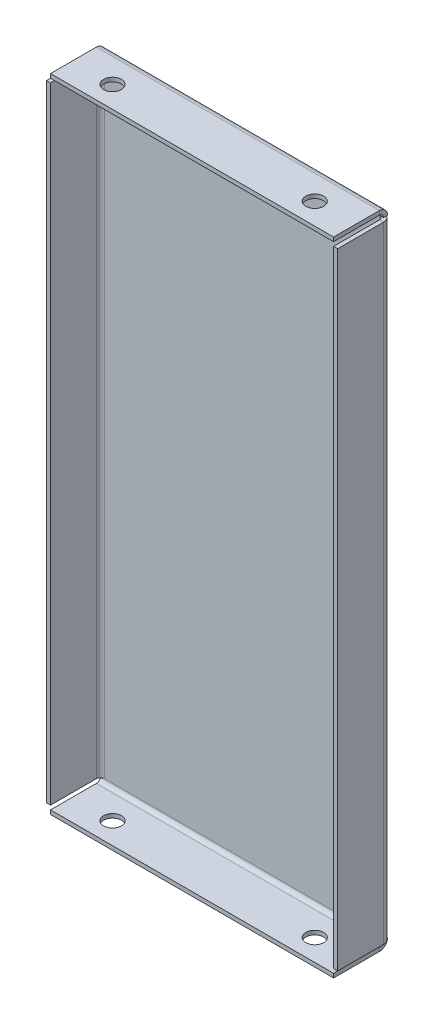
ISO-10303-21;
HEADER;
FILE_DESCRIPTION(('STEP AP214'),'2;1');
FILE_NAME('part.step','',(''),(''),'','','');
FILE_SCHEMA(('AUTOMOTIVE_DESIGN { 1 0 10303 214 1 1 1 1 }'));
ENDSEC;
DATA;
#1=APPLICATION_CONTEXT('core data for automotive mechanical design processes');
#2=APPLICATION_PROTOCOL_DEFINITION('international standard','automotive_design',2000,#1);
#3=PRODUCT_CONTEXT('',#1,'mechanical');
#4=PRODUCT('Part','Part','',(#3));
#5=PRODUCT_RELATED_PRODUCT_CATEGORY('part','',(#4));
#6=PRODUCT_DEFINITION_FORMATION('','',#4);
#7=PRODUCT_DEFINITION_CONTEXT('part definition',#1,'design');
#8=PRODUCT_DEFINITION('design','',#6,#7);
#9=PRODUCT_DEFINITION_SHAPE('','',#8);
#10=(LENGTH_UNIT() NAMED_UNIT(*) SI_UNIT(.MILLI.,.METRE.));
#11=(NAMED_UNIT(*) PLANE_ANGLE_UNIT() SI_UNIT($,.RADIAN.));
#12=(NAMED_UNIT(*) SI_UNIT($,.STERADIAN.) SOLID_ANGLE_UNIT());
#13=UNCERTAINTY_MEASURE_WITH_UNIT(LENGTH_MEASURE(1.E-05),#10,'distance_accuracy_value','');
#14=(GEOMETRIC_REPRESENTATION_CONTEXT(3) GLOBAL_UNCERTAINTY_ASSIGNED_CONTEXT((#13)) GLOBAL_UNIT_ASSIGNED_CONTEXT((#10,
#11,#12)) REPRESENTATION_CONTEXT('',''));
#15=CARTESIAN_POINT('',(0.,0.,0.));
#16=DIRECTION('',(0.,0.,1.));
#17=DIRECTION('',(1.,0.,0.));
#18=AXIS2_PLACEMENT_3D('',#15,#16,#17);
#19=CARTESIAN_POINT('',(105.,233.5,1.50000000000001));
#20=DIRECTION('',(0.,-1.,0.));
#21=DIRECTION('',(0.,0.,-1.));
#22=AXIS2_PLACEMENT_3D('',#19,#20,#21);
#23=PLANE('',#22);
#24=DIRECTION('',(0.,0.,-1.));
#25=VECTOR('',#24,1.);
#26=CARTESIAN_POINT('',(105.,233.5,1.50000000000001));
#27=LINE('',#26,#25);
#28=CARTESIAN_POINT('',(105.,233.5,0.401923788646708));
#29=VERTEX_POINT('',#28);
#30=CARTESIAN_POINT('',(105.,233.5,0.));
#31=VERTEX_POINT('',#30);
#32=EDGE_CURVE('E56',#29,#31,#27,.T.);
#33=ORIENTED_EDGE('',*,*,#32,.F.);
#34=CARTESIAN_POINT('',(103.5,233.5,3.));
#35=DIRECTION('',(0.,1.,0.));
#36=DIRECTION('',(0.,0.,1.));
#37=AXIS2_PLACEMENT_3D('',#34,#35,#36);
#38=CIRCLE('',#37,2.99999999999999);
#39=CARTESIAN_POINT('',(103.5,233.5,0.));
#40=VERTEX_POINT('',#39);
#41=EDGE_CURVE('E11',#29,#40,#38,.T.);
#42=ORIENTED_EDGE('',*,*,#41,.T.);
#43=DIRECTION('',(-1.,0.,0.));
#44=VECTOR('',#43,1.);
#45=CARTESIAN_POINT('',(0.,233.5,0.));
#46=LINE('',#45,#44);
#47=EDGE_CURVE('E295',#31,#40,#46,.T.);
#48=ORIENTED_EDGE('',*,*,#47,.F.);
#49=EDGE_LOOP('',(#33,#42,#48));
#50=FACE_BOUND('',#49,.T.);
#51=ADVANCED_FACE('F38',(#50),#23,.T.);
#52=CARTESIAN_POINT('',(103.5,1.5,1.50000000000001));
#53=DIRECTION('',(0.,1.,0.));
#54=DIRECTION('',(0.,0.,1.));
#55=AXIS2_PLACEMENT_3D('',#52,#53,#54);
#56=PLANE('',#55);
#57=DIRECTION('',(1.,0.,0.));
#58=VECTOR('',#57,1.);
#59=CARTESIAN_POINT('',(105.,1.5,0.));
#60=LINE('',#59,#58);
#61=CARTESIAN_POINT('',(105.,1.50000000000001,0.));
#62=VERTEX_POINT('',#61);
#63=CARTESIAN_POINT('',(103.5,1.50000000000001,0.));
#64=VERTEX_POINT('',#63);
#65=EDGE_CURVE('E428',#62,#64,#60,.F.);
#66=ORIENTED_EDGE('',*,*,#65,.T.);
#67=CARTESIAN_POINT('',(103.5,1.5,3.));
#68=DIRECTION('',(0.,1.,0.));
#69=DIRECTION('',(0.,0.,1.));
#70=AXIS2_PLACEMENT_3D('',#67,#68,#69);
#71=CIRCLE('',#70,2.99999999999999);
#72=CARTESIAN_POINT('',(105.,1.5,0.401923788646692));
#73=VERTEX_POINT('',#72);
#74=EDGE_CURVE('E288',#64,#73,#71,.F.);
#75=ORIENTED_EDGE('',*,*,#74,.T.);
#76=DIRECTION('',(0.,0.,-1.));
#77=VECTOR('',#76,1.);
#78=CARTESIAN_POINT('',(105.,1.5,1.5));
#79=LINE('',#78,#77);
#80=EDGE_CURVE('E436',#73,#62,#79,.T.);
#81=ORIENTED_EDGE('',*,*,#80,.T.);
#82=EDGE_LOOP('',(#66,#75,#81));
#83=FACE_BOUND('',#82,.T.);
#84=ADVANCED_FACE('F585',(#83),#56,.T.);
#85=CARTESIAN_POINT('',(0.,235.,1.5));
#86=DIRECTION('',(0.,0.,-1.));
#87=DIRECTION('',(-1.,0.,0.));
#88=AXIS2_PLACEMENT_3D('',#85,#86,#87);
#89=PLANE('',#88);
#90=DIRECTION('',(0.,1.,0.));
#91=VECTOR('',#90,1.);
#92=CARTESIAN_POINT('',(103.5,233.5,1.50000000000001));
#93=LINE('',#92,#91);
#94=CARTESIAN_POINT('',(103.5,233.5,1.50000000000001));
#95=VERTEX_POINT('',#94);
#96=CARTESIAN_POINT('',(103.5,1.5,1.5));
#97=VERTEX_POINT('',#96);
#98=EDGE_CURVE('E278',#95,#97,#93,.F.);
#99=ORIENTED_EDGE('',*,*,#98,.F.);
#100=DIRECTION('',(-1.,0.,0.));
#101=VECTOR('',#100,1.);
#102=CARTESIAN_POINT('',(0.,233.5,1.50000000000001));
#103=LINE('',#102,#101);
#104=CARTESIAN_POINT('',(1.50000000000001,233.5,1.50000000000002));
#105=VERTEX_POINT('',#104);
#106=EDGE_CURVE('E503',#105,#95,#103,.F.);
#107=ORIENTED_EDGE('',*,*,#106,.F.);
#108=DIRECTION('',(0.,-1.,0.));
#109=VECTOR('',#108,1.);
#110=CARTESIAN_POINT('',(1.50000000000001,1.5,1.50000000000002));
#111=LINE('',#110,#109);
#112=CARTESIAN_POINT('',(1.50000000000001,1.50000000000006,1.50000000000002));
#113=VERTEX_POINT('',#112);
#114=EDGE_CURVE('E347',#113,#105,#111,.F.);
#115=ORIENTED_EDGE('',*,*,#114,.F.);
#116=DIRECTION('',(1.,0.,0.));
#117=VECTOR('',#116,1.);
#118=CARTESIAN_POINT('',(105.,1.5,1.5));
#119=LINE('',#118,#117);
#120=EDGE_CURVE('E64',#97,#113,#119,.F.);
#121=ORIENTED_EDGE('',*,*,#120,.F.);
#122=EDGE_LOOP('',(#99,#107,#115,#121));
#123=FACE_BOUND('',#122,.T.);
#124=ADVANCED_FACE('F40',(#123),#89,.F.);
#125=CARTESIAN_POINT('',(0.,235.,0.));
#126=DIRECTION('',(0.,0.,-1.));
#127=DIRECTION('',(-1.,0.,0.));
#128=AXIS2_PLACEMENT_3D('',#125,#126,#127);
#129=PLANE('',#128);
#130=DIRECTION('',(-1.,0.,0.));
#131=VECTOR('',#130,1.);
#132=CARTESIAN_POINT('',(0.,233.5,0.));
#133=LINE('',#132,#131);
#134=CARTESIAN_POINT('',(1.50000000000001,233.5,0.));
#135=VERTEX_POINT('',#134);
#136=EDGE_CURVE('E511',#135,#40,#133,.F.);
#137=ORIENTED_EDGE('',*,*,#136,.T.);
#138=DIRECTION('',(0.,1.,0.));
#139=VECTOR('',#138,1.);
#140=CARTESIAN_POINT('',(103.5,233.5,0.));
#141=LINE('',#140,#139);
#142=EDGE_CURVE('E225',#40,#64,#141,.F.);
#143=ORIENTED_EDGE('',*,*,#142,.T.);
#144=CARTESIAN_POINT('',(1.5,1.50000000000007,0.));
#145=VERTEX_POINT('',#144);
#146=EDGE_CURVE('E432',#64,#145,#60,.F.);
#147=ORIENTED_EDGE('',*,*,#146,.T.);
#148=DIRECTION('',(0.,-1.,0.));
#149=VECTOR('',#148,1.);
#150=CARTESIAN_POINT('',(1.50000000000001,1.5,0.));
#151=LINE('',#150,#149);
#152=EDGE_CURVE('E354',#145,#135,#151,.F.);
#153=ORIENTED_EDGE('',*,*,#152,.T.);
#154=EDGE_LOOP('',(#137,#143,#147,#153));
#155=FACE_BOUND('',#154,.T.);
#156=ADVANCED_FACE('F578',(#155),#129,.T.);
#157=CARTESIAN_POINT('',(0.,1.5,1.5));
#158=DIRECTION('',(0.,1.,0.));
#159=DIRECTION('',(-1.,0.,0.));
#160=AXIS2_PLACEMENT_3D('',#157,#158,#159);
#161=PLANE('',#160);
#162=DIRECTION('',(0.,0.,-1.));
#163=VECTOR('',#162,1.);
#164=CARTESIAN_POINT('',(0.,1.5,1.5));
#165=LINE('',#164,#163);
#166=CARTESIAN_POINT('',(0.,1.5,0.401923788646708));
#167=VERTEX_POINT('',#166);
#168=CARTESIAN_POINT('',(0.,1.50000000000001,0.));
#169=VERTEX_POINT('',#168);
#170=EDGE_CURVE('E445',#167,#169,#165,.T.);
#171=ORIENTED_EDGE('',*,*,#170,.F.);
#172=CARTESIAN_POINT('',(1.50000000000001,1.50000000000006,3.));
#173=DIRECTION('',(0.,-1.,0.));
#174=DIRECTION('',(0.,0.,-1.));
#175=AXIS2_PLACEMENT_3D('',#172,#173,#174);
#176=CIRCLE('',#175,2.99999999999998);
#177=EDGE_CURVE('E48',#167,#145,#176,.T.);
#178=ORIENTED_EDGE('',*,*,#177,.T.);
#179=DIRECTION('',(1.,0.,0.));
#180=VECTOR('',#179,1.);
#181=CARTESIAN_POINT('',(105.,1.50000000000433,0.));
#182=LINE('',#181,#180);
#183=EDGE_CURVE('E370',#169,#145,#182,.T.);
#184=ORIENTED_EDGE('',*,*,#183,.F.);
#185=EDGE_LOOP('',(#171,#178,#184));
#186=FACE_BOUND('',#185,.T.);
#187=ADVANCED_FACE('F680',(#186),#161,.T.);
#188=CARTESIAN_POINT('',(1.50000000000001,233.5,1.50000000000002));
#189=DIRECTION('',(0.,-1.,0.));
#190=DIRECTION('',(0.,0.,-1.));
#191=AXIS2_PLACEMENT_3D('',#188,#189,#190);
#192=PLANE('',#191);
#193=CARTESIAN_POINT('',(0.,233.5,0.));
#194=VERTEX_POINT('',#193);
#195=EDGE_CURVE('E507',#194,#135,#133,.F.);
#196=ORIENTED_EDGE('',*,*,#195,.T.);
#197=CARTESIAN_POINT('',(1.50000000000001,233.5,3.));
#198=DIRECTION('',(0.,-1.,0.));
#199=DIRECTION('',(0.,0.,-1.));
#200=AXIS2_PLACEMENT_3D('',#197,#198,#199);
#201=CIRCLE('',#200,2.99999999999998);
#202=CARTESIAN_POINT('',(0.,233.5,0.401923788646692));
#203=VERTEX_POINT('',#202);
#204=EDGE_CURVE('E359',#135,#203,#201,.F.);
#205=ORIENTED_EDGE('',*,*,#204,.T.);
#206=DIRECTION('',(0.,0.,-1.));
#207=VECTOR('',#206,1.);
#208=CARTESIAN_POINT('',(0.,233.5,1.50000000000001));
#209=LINE('',#208,#207);
#210=EDGE_CURVE('E515',#203,#194,#209,.T.);
#211=ORIENTED_EDGE('',*,*,#210,.T.);
#212=EDGE_LOOP('',(#196,#205,#211));
#213=FACE_BOUND('',#212,.T.);
#214=ADVANCED_FACE('F677',(#213),#192,.T.);
#215=CARTESIAN_POINT('',(105.,233.5,3.00000000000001));
#216=DIRECTION('',(1.,0.,0.));
#217=DIRECTION('',(0.,0.,-1.));
#218=AXIS2_PLACEMENT_3D('',#215,#216,#217);
#219=PLANE('',#218);
#220=DIRECTION('',(0.,1.,0.));
#221=VECTOR('',#220,1.);
#222=CARTESIAN_POINT('',(105.,235.,3.));
#223=LINE('',#222,#221);
#224=CARTESIAN_POINT('',(105.,235.,3.));
#225=VERTEX_POINT('',#224);
#226=CARTESIAN_POINT('',(105.,236.5,3.));
#227=VERTEX_POINT('',#226);
#228=EDGE_CURVE('E444',#225,#227,#223,.T.);
#229=ORIENTED_EDGE('',*,*,#228,.F.);
#230=CARTESIAN_POINT('',(105.,233.5,3.00000000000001));
#231=DIRECTION('',(-1.,0.,0.));
#232=DIRECTION('',(0.,0.,1.));
#233=AXIS2_PLACEMENT_3D('',#230,#231,#232);
#234=CIRCLE('',#233,1.5);
#235=CARTESIAN_POINT('',(105.,233.5,1.50000000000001));
#236=VERTEX_POINT('',#235);
#237=EDGE_CURVE('E494',#236,#225,#234,.F.);
#238=ORIENTED_EDGE('',*,*,#237,.F.);
#239=EDGE_CURVE('E519',#236,#29,#27,.T.);
#240=ORIENTED_EDGE('',*,*,#239,.T.);
#241=ORIENTED_EDGE('',*,*,#32,.T.);
#242=CARTESIAN_POINT('',(105.,233.5,3.00000000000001));
#243=DIRECTION('',(-1.,0.,0.));
#244=DIRECTION('',(0.,0.,1.));
#245=AXIS2_PLACEMENT_3D('',#242,#243,#244);
#246=CIRCLE('',#245,3.);
#247=EDGE_CURVE('E510',#31,#227,#246,.F.);
#248=ORIENTED_EDGE('',*,*,#247,.T.);
#249=EDGE_LOOP('',(#229,#238,#240,#241,#248));
#250=FACE_BOUND('',#249,.T.);
#251=ADVANCED_FACE('F679',(#250),#219,.T.);
#252=CARTESIAN_POINT('',(0.,233.5,3.00000000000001));
#253=DIRECTION('',(1.,0.,0.));
#254=DIRECTION('',(0.,0.,-1.));
#255=AXIS2_PLACEMENT_3D('',#252,#253,#254);
#256=PLANE('',#255);
#257=CARTESIAN_POINT('',(0.,233.5,3.00000000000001));
#258=DIRECTION('',(-1.,0.,0.));
#259=DIRECTION('',(0.,0.,1.));
#260=AXIS2_PLACEMENT_3D('',#257,#258,#259);
#261=CIRCLE('',#260,1.5);
#262=CARTESIAN_POINT('',(0.,235.,3.));
#263=VERTEX_POINT('',#262);
#264=CARTESIAN_POINT('',(0.,233.5,1.50000000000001));
#265=VERTEX_POINT('',#264);
#266=EDGE_CURVE('E490',#263,#265,#261,.T.);
#267=ORIENTED_EDGE('',*,*,#266,.F.);
#268=DIRECTION('',(0.,1.,0.));
#269=VECTOR('',#268,1.);
#270=CARTESIAN_POINT('',(0.,235.,3.));
#271=LINE('',#270,#269);
#272=CARTESIAN_POINT('',(0.,236.5,3.));
#273=VERTEX_POINT('',#272);
#274=EDGE_CURVE('E453',#263,#273,#271,.T.);
#275=ORIENTED_EDGE('',*,*,#274,.T.);
#276=CARTESIAN_POINT('',(0.,233.5,3.00000000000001));
#277=DIRECTION('',(-1.,0.,0.));
#278=DIRECTION('',(0.,0.,1.));
#279=AXIS2_PLACEMENT_3D('',#276,#277,#278);
#280=CIRCLE('',#279,3.);
#281=EDGE_CURVE('E498',#273,#194,#280,.T.);
#282=ORIENTED_EDGE('',*,*,#281,.T.);
#283=ORIENTED_EDGE('',*,*,#210,.F.);
#284=EDGE_CURVE('E522',#265,#203,#209,.T.);
#285=ORIENTED_EDGE('',*,*,#284,.F.);
#286=EDGE_LOOP('',(#267,#275,#282,#283,#285));
#287=FACE_BOUND('',#286,.T.);
#288=ADVANCED_FACE('F1140',(#287),#256,.F.);
#289=CARTESIAN_POINT('',(0.,233.5,3.00000000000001));
#290=DIRECTION('',(-1.,0.,0.));
#291=DIRECTION('',(0.,1.,0.));
#292=AXIS2_PLACEMENT_3D('',#289,#290,#291);
#293=CYLINDRICAL_SURFACE('',#292,3.);
#294=ORIENTED_EDGE('',*,*,#195,.F.);
#295=ORIENTED_EDGE('',*,*,#281,.F.);
#296=DIRECTION('',(-1.,0.,0.));
#297=VECTOR('',#296,1.);
#298=CARTESIAN_POINT('',(0.,236.5,3.));
#299=LINE('',#298,#297);
#300=EDGE_CURVE('E457',#227,#273,#299,.T.);
#301=ORIENTED_EDGE('',*,*,#300,.F.);
#302=ORIENTED_EDGE('',*,*,#247,.F.);
#303=ORIENTED_EDGE('',*,*,#47,.T.);
#304=ORIENTED_EDGE('',*,*,#136,.F.);
#305=EDGE_LOOP('',(#294,#295,#301,#302,#303,#304));
#306=FACE_BOUND('',#305,.T.);
#307=ADVANCED_FACE('F1138',(#306),#293,.T.);
#308=CARTESIAN_POINT('',(0.,233.5,3.00000000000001));
#309=DIRECTION('',(-1.,0.,0.));
#310=DIRECTION('',(0.,1.,0.));
#311=AXIS2_PLACEMENT_3D('',#308,#309,#310);
#312=CYLINDRICAL_SURFACE('',#311,1.5);
#313=EDGE_CURVE('E499',#265,#105,#103,.F.);
#314=ORIENTED_EDGE('',*,*,#313,.T.);
#315=ORIENTED_EDGE('',*,*,#106,.T.);
#316=DIRECTION('',(-1.,0.,0.));
#317=VECTOR('',#316,1.);
#318=CARTESIAN_POINT('',(105.,233.5,1.50000000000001));
#319=LINE('',#318,#317);
#320=EDGE_CURVE('E291',#236,#95,#319,.T.);
#321=ORIENTED_EDGE('',*,*,#320,.F.);
#322=ORIENTED_EDGE('',*,*,#237,.T.);
#323=DIRECTION('',(-1.,0.,0.));
#324=VECTOR('',#323,1.);
#325=CARTESIAN_POINT('',(105.,235.,3.));
#326=LINE('',#325,#324);
#327=EDGE_CURVE('E450',#225,#263,#326,.T.);
#328=ORIENTED_EDGE('',*,*,#327,.T.);
#329=ORIENTED_EDGE('',*,*,#266,.T.);
#330=EDGE_LOOP('',(#314,#315,#321,#322,#328,#329));
#331=FACE_BOUND('',#330,.T.);
#332=ADVANCED_FACE('F708',(#331),#312,.F.);
#333=CARTESIAN_POINT('',(0.,236.5,1.49999999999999));
#334=DIRECTION('',(-1.,0.,0.));
#335=DIRECTION('',(0.,0.,1.));
#336=AXIS2_PLACEMENT_3D('',#333,#334,#335);
#337=PLANE('',#336);
#338=DIRECTION('',(0.,0.,-1.));
#339=VECTOR('',#338,1.);
#340=CARTESIAN_POINT('',(0.,236.5,1.49999999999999));
#341=LINE('',#340,#339);
#342=CARTESIAN_POINT('',(0.,236.5,20.));
#343=VERTEX_POINT('',#342);
#344=EDGE_CURVE('E482',#343,#273,#341,.T.);
#345=ORIENTED_EDGE('',*,*,#344,.T.);
#346=ORIENTED_EDGE('',*,*,#274,.F.);
#347=DIRECTION('',(0.,0.,-1.));
#348=VECTOR('',#347,1.);
#349=CARTESIAN_POINT('',(0.,235.,1.5));
#350=LINE('',#349,#348);
#351=CARTESIAN_POINT('',(0.,235.,20.));
#352=VERTEX_POINT('',#351);
#353=EDGE_CURVE('E471',#352,#263,#350,.T.);
#354=ORIENTED_EDGE('',*,*,#353,.F.);
#355=DIRECTION('',(0.,-1.,0.));
#356=VECTOR('',#355,1.);
#357=CARTESIAN_POINT('',(0.,236.5,20.));
#358=LINE('',#357,#356);
#359=EDGE_CURVE('E487',#343,#352,#358,.T.);
#360=ORIENTED_EDGE('',*,*,#359,.F.);
#361=EDGE_LOOP('',(#345,#346,#354,#360));
#362=FACE_BOUND('',#361,.T.);
#363=ADVANCED_FACE('F1116',(#362),#337,.T.);
#364=CARTESIAN_POINT('',(105.,236.5,20.));
#365=DIRECTION('',(1.,0.,0.));
#366=DIRECTION('',(0.,0.,-1.));
#367=AXIS2_PLACEMENT_3D('',#364,#365,#366);
#368=PLANE('',#367);
#369=DIRECTION('',(0.,0.,1.));
#370=VECTOR('',#369,1.);
#371=CARTESIAN_POINT('',(105.,235.,20.));
#372=LINE('',#371,#370);
#373=CARTESIAN_POINT('',(105.,235.,20.));
#374=VERTEX_POINT('',#373);
#375=EDGE_CURVE('E464',#225,#374,#372,.T.);
#376=ORIENTED_EDGE('',*,*,#375,.F.);
#377=ORIENTED_EDGE('',*,*,#228,.T.);
#378=DIRECTION('',(0.,0.,1.));
#379=VECTOR('',#378,1.);
#380=CARTESIAN_POINT('',(105.,236.5,20.));
#381=LINE('',#380,#379);
#382=CARTESIAN_POINT('',(105.,236.5,20.));
#383=VERTEX_POINT('',#382);
#384=EDGE_CURVE('E475',#227,#383,#381,.T.);
#385=ORIENTED_EDGE('',*,*,#384,.T.);
#386=DIRECTION('',(0.,-1.,0.));
#387=VECTOR('',#386,1.);
#388=CARTESIAN_POINT('',(105.,236.5,20.));
#389=LINE('',#388,#387);
#390=EDGE_CURVE('E486',#383,#374,#389,.T.);
#391=ORIENTED_EDGE('',*,*,#390,.T.);
#392=EDGE_LOOP('',(#376,#377,#385,#391));
#393=FACE_BOUND('',#392,.T.);
#394=ADVANCED_FACE('F1105',(#393),#368,.T.);
#395=CARTESIAN_POINT('',(0.,236.5,1.49999999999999));
#396=DIRECTION('',(0.,1.,0.));
#397=DIRECTION('',(0.,0.,1.));
#398=AXIS2_PLACEMENT_3D('',#395,#396,#397);
#399=PLANE('',#398);
#400=CARTESIAN_POINT('',(15.,236.5,12.));
#401=DIRECTION('',(0.,1.,0.));
#402=DIRECTION('',(0.,0.,1.));
#403=AXIS2_PLACEMENT_3D('',#400,#401,#402);
#404=CIRCLE('',#403,3.29999999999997);
#405=CARTESIAN_POINT('',(15.,236.5,15.3));
#406=VERTEX_POINT('',#405);
#407=EDGE_CURVE('E714',#406,#406,#404,.T.);
#408=ORIENTED_EDGE('',*,*,#407,.F.);
#409=EDGE_LOOP('',(#408));
#410=FACE_BOUND('',#409,.T.);
#411=CARTESIAN_POINT('',(90.,236.5,12.));
#412=DIRECTION('',(0.,1.,0.));
#413=DIRECTION('',(0.,0.,1.));
#414=AXIS2_PLACEMENT_3D('',#411,#412,#413);
#415=CIRCLE('',#414,3.29999999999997);
#416=CARTESIAN_POINT('',(90.,236.5,15.3));
#417=VERTEX_POINT('',#416);
#418=EDGE_CURVE('E529',#417,#417,#415,.T.);
#419=ORIENTED_EDGE('',*,*,#418,.F.);
#420=EDGE_LOOP('',(#419));
#421=FACE_BOUND('',#420,.T.);
#422=ORIENTED_EDGE('',*,*,#384,.F.);
#423=ORIENTED_EDGE('',*,*,#300,.T.);
#424=ORIENTED_EDGE('',*,*,#344,.F.);
#425=DIRECTION('',(-1.,0.,0.));
#426=VECTOR('',#425,1.);
#427=CARTESIAN_POINT('',(0.,236.5,20.));
#428=LINE('',#427,#426);
#429=EDGE_CURVE('E478',#383,#343,#428,.T.);
#430=ORIENTED_EDGE('',*,*,#429,.F.);
#431=EDGE_LOOP('',(#422,#423,#424,#430));
#432=FACE_BOUND('',#431,.T.);
#433=ADVANCED_FACE('F1094',(#410,#421,#432),#399,.T.);
#434=CARTESIAN_POINT('',(0.,235.,1.5));
#435=DIRECTION('',(0.,1.,0.));
#436=DIRECTION('',(0.,0.,1.));
#437=AXIS2_PLACEMENT_3D('',#434,#435,#436);
#438=PLANE('',#437);
#439=CARTESIAN_POINT('',(15.,235.,12.));
#440=DIRECTION('',(0.,1.,0.));
#441=DIRECTION('',(0.,0.,1.));
#442=AXIS2_PLACEMENT_3D('',#439,#440,#441);
#443=CIRCLE('',#442,3.29999999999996);
#444=CARTESIAN_POINT('',(15.,235.,15.3));
#445=VERTEX_POINT('',#444);
#446=EDGE_CURVE('E544',#445,#445,#443,.T.);
#447=ORIENTED_EDGE('',*,*,#446,.T.);
#448=EDGE_LOOP('',(#447));
#449=FACE_BOUND('',#448,.T.);
#450=CARTESIAN_POINT('',(90.,235.,12.));
#451=DIRECTION('',(0.,1.,0.));
#452=DIRECTION('',(0.,0.,1.));
#453=AXIS2_PLACEMENT_3D('',#450,#451,#452);
#454=CIRCLE('',#453,3.29999999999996);
#455=CARTESIAN_POINT('',(90.,235.,15.3));
#456=VERTEX_POINT('',#455);
#457=EDGE_CURVE('E528',#456,#456,#454,.T.);
#458=ORIENTED_EDGE('',*,*,#457,.T.);
#459=EDGE_LOOP('',(#458));
#460=FACE_BOUND('',#459,.T.);
#461=ORIENTED_EDGE('',*,*,#327,.F.);
#462=ORIENTED_EDGE('',*,*,#375,.T.);
#463=DIRECTION('',(-1.,0.,0.));
#464=VECTOR('',#463,1.);
#465=CARTESIAN_POINT('',(0.,235.,20.));
#466=LINE('',#465,#464);
#467=EDGE_CURVE('E467',#374,#352,#466,.T.);
#468=ORIENTED_EDGE('',*,*,#467,.T.);
#469=ORIENTED_EDGE('',*,*,#353,.T.);
#470=EDGE_LOOP('',(#461,#462,#468,#469));
#471=FACE_BOUND('',#470,.T.);
#472=ADVANCED_FACE('F1082',(#449,#460,#471),#438,.F.);
#473=CARTESIAN_POINT('',(0.,236.5,20.));
#474=DIRECTION('',(0.,0.,1.));
#475=DIRECTION('',(0.,-1.,0.));
#476=AXIS2_PLACEMENT_3D('',#473,#474,#475);
#477=PLANE('',#476);
#478=ORIENTED_EDGE('',*,*,#467,.F.);
#479=ORIENTED_EDGE('',*,*,#390,.F.);
#480=ORIENTED_EDGE('',*,*,#429,.T.);
#481=ORIENTED_EDGE('',*,*,#359,.T.);
#482=EDGE_LOOP('',(#478,#479,#480,#481));
#483=FACE_BOUND('',#482,.T.);
#484=ADVANCED_FACE('F1072',(#483),#477,.T.);
#485=CARTESIAN_POINT('',(0.,1.49999999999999,3.));
#486=DIRECTION('',(-1.,0.,0.));
#487=DIRECTION('',(0.,0.,1.));
#488=AXIS2_PLACEMENT_3D('',#485,#486,#487);
#489=PLANE('',#488);
#490=DIRECTION('',(0.,-1.,0.));
#491=VECTOR('',#490,1.);
#492=CARTESIAN_POINT('',(0.,0.,2.99999999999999));
#493=LINE('',#492,#491);
#494=CARTESIAN_POINT('',(0.,0.,2.99999999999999));
#495=VERTEX_POINT('',#494);
#496=CARTESIAN_POINT('',(0.,-1.50000000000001,2.99999999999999));
#497=VERTEX_POINT('',#496);
#498=EDGE_CURVE('E374',#495,#497,#493,.T.);
#499=ORIENTED_EDGE('',*,*,#498,.F.);
#500=CARTESIAN_POINT('',(0.,1.49999999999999,3.));
#501=DIRECTION('',(1.,0.,0.));
#502=DIRECTION('',(0.,0.,-1.));
#503=AXIS2_PLACEMENT_3D('',#500,#501,#502);
#504=CIRCLE('',#503,1.5);
#505=CARTESIAN_POINT('',(0.,1.5,1.5));
#506=VERTEX_POINT('',#505);
#507=EDGE_CURVE('E417',#506,#495,#504,.F.);
#508=ORIENTED_EDGE('',*,*,#507,.F.);
#509=EDGE_CURVE('E440',#506,#167,#165,.T.);
#510=ORIENTED_EDGE('',*,*,#509,.T.);
#511=ORIENTED_EDGE('',*,*,#170,.T.);
#512=CARTESIAN_POINT('',(0.,1.49999999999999,3.));
#513=DIRECTION('',(1.,0.,0.));
#514=DIRECTION('',(0.,0.,-1.));
#515=AXIS2_PLACEMENT_3D('',#512,#513,#514);
#516=CIRCLE('',#515,3.);
#517=EDGE_CURVE('E431',#169,#497,#516,.F.);
#518=ORIENTED_EDGE('',*,*,#517,.T.);
#519=EDGE_LOOP('',(#499,#508,#510,#511,#518));
#520=FACE_BOUND('',#519,.T.);
#521=ADVANCED_FACE('F613',(#520),#489,.T.);
#522=CARTESIAN_POINT('',(105.,1.49999999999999,3.));
#523=DIRECTION('',(-1.,0.,0.));
#524=DIRECTION('',(0.,0.,1.));
#525=AXIS2_PLACEMENT_3D('',#522,#523,#524);
#526=PLANE('',#525);
#527=CARTESIAN_POINT('',(105.,1.49999999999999,3.));
#528=DIRECTION('',(1.,0.,0.));
#529=DIRECTION('',(0.,0.,-1.));
#530=AXIS2_PLACEMENT_3D('',#527,#528,#529);
#531=CIRCLE('',#530,1.5);
#532=CARTESIAN_POINT('',(105.,0.,2.99999999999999));
#533=VERTEX_POINT('',#532);
#534=CARTESIAN_POINT('',(105.,1.5,1.5));
#535=VERTEX_POINT('',#534);
#536=EDGE_CURVE('E416',#533,#535,#531,.T.);
#537=ORIENTED_EDGE('',*,*,#536,.F.);
#538=DIRECTION('',(0.,-1.,0.));
#539=VECTOR('',#538,1.);
#540=CARTESIAN_POINT('',(105.,0.,2.99999999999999));
#541=LINE('',#540,#539);
#542=CARTESIAN_POINT('',(105.,-1.50000000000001,2.99999999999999));
#543=VERTEX_POINT('',#542);
#544=EDGE_CURVE('E378',#533,#543,#541,.T.);
#545=ORIENTED_EDGE('',*,*,#544,.T.);
#546=CARTESIAN_POINT('',(105.,1.49999999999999,3.));
#547=DIRECTION('',(1.,0.,0.));
#548=DIRECTION('',(0.,0.,-1.));
#549=AXIS2_PLACEMENT_3D('',#546,#547,#548);
#550=CIRCLE('',#549,3.);
#551=EDGE_CURVE('E421',#543,#62,#550,.T.);
#552=ORIENTED_EDGE('',*,*,#551,.T.);
#553=ORIENTED_EDGE('',*,*,#80,.F.);
#554=EDGE_CURVE('E446',#535,#73,#79,.T.);
#555=ORIENTED_EDGE('',*,*,#554,.F.);
#556=EDGE_LOOP('',(#537,#545,#552,#553,#555));
#557=FACE_BOUND('',#556,.T.);
#558=ADVANCED_FACE('F591',(#557),#526,.F.);
#559=CARTESIAN_POINT('',(105.,1.49999999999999,3.));
#560=DIRECTION('',(1.,0.,0.));
#561=DIRECTION('',(0.,-1.,0.));
#562=AXIS2_PLACEMENT_3D('',#559,#560,#561);
#563=CYLINDRICAL_SURFACE('',#562,3.);
#564=ORIENTED_EDGE('',*,*,#65,.F.);
#565=ORIENTED_EDGE('',*,*,#551,.F.);
#566=DIRECTION('',(-1.,0.,0.));
#567=VECTOR('',#566,1.);
#568=CARTESIAN_POINT('',(0.,-1.50000000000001,2.99999999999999));
#569=LINE('',#568,#567);
#570=EDGE_CURVE('E382',#543,#497,#569,.T.);
#571=ORIENTED_EDGE('',*,*,#570,.T.);
#572=ORIENTED_EDGE('',*,*,#517,.F.);
#573=ORIENTED_EDGE('',*,*,#183,.T.);
#574=ORIENTED_EDGE('',*,*,#146,.F.);
#575=EDGE_LOOP('',(#564,#565,#571,#572,#573,#574));
#576=FACE_BOUND('',#575,.T.);
#577=ADVANCED_FACE('F588',(#576),#563,.T.);
#578=CARTESIAN_POINT('',(105.,1.49999999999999,3.));
#579=DIRECTION('',(1.,0.,0.));
#580=DIRECTION('',(0.,-1.,0.));
#581=AXIS2_PLACEMENT_3D('',#578,#579,#580);
#582=CYLINDRICAL_SURFACE('',#581,1.5);
#583=EDGE_CURVE('E422',#535,#97,#119,.F.);
#584=ORIENTED_EDGE('',*,*,#583,.T.);
#585=ORIENTED_EDGE('',*,*,#120,.T.);
#586=DIRECTION('',(1.,0.,0.));
#587=VECTOR('',#586,1.);
#588=CARTESIAN_POINT('',(0.,1.5,1.5));
#589=LINE('',#588,#587);
#590=EDGE_CURVE('E363',#506,#113,#589,.T.);
#591=ORIENTED_EDGE('',*,*,#590,.F.);
#592=ORIENTED_EDGE('',*,*,#507,.T.);
#593=DIRECTION('',(1.,0.,0.));
#594=VECTOR('',#593,1.);
#595=CARTESIAN_POINT('',(0.,0.,2.99999999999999));
#596=LINE('',#595,#594);
#597=EDGE_CURVE('E375',#495,#533,#596,.T.);
#598=ORIENTED_EDGE('',*,*,#597,.T.);
#599=ORIENTED_EDGE('',*,*,#536,.T.);
#600=EDGE_LOOP('',(#584,#585,#591,#592,#598,#599));
#601=FACE_BOUND('',#600,.T.);
#602=ADVANCED_FACE('F617',(#601),#582,.F.);
#603=CARTESIAN_POINT('',(0.,-1.5,1.49999999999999));
#604=DIRECTION('',(1.,0.,0.));
#605=DIRECTION('',(0.,0.,-1.));
#606=AXIS2_PLACEMENT_3D('',#603,#604,#605);
#607=PLANE('',#606);
#608=ORIENTED_EDGE('',*,*,#498,.T.);
#609=DIRECTION('',(0.,0.,-1.));
#610=VECTOR('',#609,1.);
#611=CARTESIAN_POINT('',(0.,-1.5,1.49999999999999));
#612=LINE('',#611,#610);
#613=CARTESIAN_POINT('',(0.,-1.50000000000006,20.));
#614=VERTEX_POINT('',#613);
#615=EDGE_CURVE('E398',#614,#497,#612,.T.);
#616=ORIENTED_EDGE('',*,*,#615,.F.);
#617=DIRECTION('',(0.,1.,0.));
#618=VECTOR('',#617,1.);
#619=CARTESIAN_POINT('',(0.,-1.50000000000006,20.));
#620=LINE('',#619,#618);
#621=CARTESIAN_POINT('',(0.,0.,20.));
#622=VERTEX_POINT('',#621);
#623=EDGE_CURVE('E408',#614,#622,#620,.T.);
#624=ORIENTED_EDGE('',*,*,#623,.T.);
#625=DIRECTION('',(0.,0.,-1.));
#626=VECTOR('',#625,1.);
#627=CARTESIAN_POINT('',(0.,0.,1.5));
#628=LINE('',#627,#626);
#629=EDGE_CURVE('E388',#622,#495,#628,.T.);
#630=ORIENTED_EDGE('',*,*,#629,.T.);
#631=EDGE_LOOP('',(#608,#616,#624,#630));
#632=FACE_BOUND('',#631,.T.);
#633=ADVANCED_FACE('F610',(#632),#607,.F.);
#634=CARTESIAN_POINT('',(105.,-1.50000000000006,20.));
#635=DIRECTION('',(-1.,0.,0.));
#636=DIRECTION('',(0.,0.,1.));
#637=AXIS2_PLACEMENT_3D('',#634,#635,#636);
#638=PLANE('',#637);
#639=ORIENTED_EDGE('',*,*,#544,.F.);
#640=DIRECTION('',(0.,0.,1.));
#641=VECTOR('',#640,1.);
#642=CARTESIAN_POINT('',(105.,0.,20.));
#643=LINE('',#642,#641);
#644=CARTESIAN_POINT('',(105.,0.,20.));
#645=VERTEX_POINT('',#644);
#646=EDGE_CURVE('E392',#533,#645,#643,.T.);
#647=ORIENTED_EDGE('',*,*,#646,.T.);
#648=DIRECTION('',(0.,1.,0.));
#649=VECTOR('',#648,1.);
#650=CARTESIAN_POINT('',(105.,-1.50000000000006,20.));
#651=LINE('',#650,#649);
#652=CARTESIAN_POINT('',(105.,-1.50000000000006,20.));
#653=VERTEX_POINT('',#652);
#654=EDGE_CURVE('E412',#653,#645,#651,.T.);
#655=ORIENTED_EDGE('',*,*,#654,.F.);
#656=DIRECTION('',(0.,0.,1.));
#657=VECTOR('',#656,1.);
#658=CARTESIAN_POINT('',(105.,-1.50000000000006,20.));
#659=LINE('',#658,#657);
#660=EDGE_CURVE('E402',#543,#653,#659,.T.);
#661=ORIENTED_EDGE('',*,*,#660,.F.);
#662=EDGE_LOOP('',(#639,#647,#655,#661));
#663=FACE_BOUND('',#662,.T.);
#664=ADVANCED_FACE('F602',(#663),#638,.F.);
#665=CARTESIAN_POINT('',(0.,-1.50000000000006,20.));
#666=DIRECTION('',(0.,1.,0.));
#667=DIRECTION('',(0.,0.,1.));
#668=AXIS2_PLACEMENT_3D('',#665,#666,#667);
#669=PLANE('',#668);
#670=CARTESIAN_POINT('',(15.,-1.50000000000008,12.0000000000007));
#671=DIRECTION('',(0.,1.,0.));
#672=DIRECTION('',(0.,0.,1.));
#673=AXIS2_PLACEMENT_3D('',#670,#671,#672);
#674=CIRCLE('',#673,3.29999999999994);
#675=CARTESIAN_POINT('',(15.,-1.50000000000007,15.3000000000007));
#676=VERTEX_POINT('',#675);
#677=EDGE_CURVE('E720',#676,#676,#674,.T.);
#678=ORIENTED_EDGE('',*,*,#677,.T.);
#679=EDGE_LOOP('',(#678));
#680=FACE_BOUND('',#679,.T.);
#681=CARTESIAN_POINT('',(90.,-1.50000000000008,12.0000000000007));
#682=DIRECTION('',(0.,1.,0.));
#683=DIRECTION('',(0.,0.,1.));
#684=AXIS2_PLACEMENT_3D('',#681,#682,#683);
#685=CIRCLE('',#684,3.29999999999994);
#686=CARTESIAN_POINT('',(90.,-1.50000000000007,15.3000000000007));
#687=VERTEX_POINT('',#686);
#688=EDGE_CURVE('E538',#687,#687,#685,.T.);
#689=ORIENTED_EDGE('',*,*,#688,.T.);
#690=EDGE_LOOP('',(#689));
#691=FACE_BOUND('',#690,.T.);
#692=ORIENTED_EDGE('',*,*,#570,.F.);
#693=ORIENTED_EDGE('',*,*,#660,.T.);
#694=DIRECTION('',(-1.,0.,0.));
#695=VECTOR('',#694,1.);
#696=CARTESIAN_POINT('',(0.,-1.50000000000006,20.));
#697=LINE('',#696,#695);
#698=EDGE_CURVE('E405',#653,#614,#697,.T.);
#699=ORIENTED_EDGE('',*,*,#698,.T.);
#700=ORIENTED_EDGE('',*,*,#615,.T.);
#701=EDGE_LOOP('',(#692,#693,#699,#700));
#702=FACE_BOUND('',#701,.T.);
#703=ADVANCED_FACE('F598',(#680,#691,#702),#669,.F.);
#704=CARTESIAN_POINT('',(0.,0.,20.));
#705=DIRECTION('',(0.,1.,0.));
#706=DIRECTION('',(0.,0.,1.));
#707=AXIS2_PLACEMENT_3D('',#704,#705,#706);
#708=PLANE('',#707);
#709=CARTESIAN_POINT('',(15.,0.,12.0000000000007));
#710=DIRECTION('',(0.,1.,0.));
#711=DIRECTION('',(0.,0.,1.));
#712=AXIS2_PLACEMENT_3D('',#709,#710,#711);
#713=CIRCLE('',#712,3.29999999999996);
#714=CARTESIAN_POINT('',(15.,0.,15.3000000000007));
#715=VERTEX_POINT('',#714);
#716=EDGE_CURVE('E42',#715,#715,#713,.T.);
#717=ORIENTED_EDGE('',*,*,#716,.F.);
#718=EDGE_LOOP('',(#717));
#719=FACE_BOUND('',#718,.T.);
#720=CARTESIAN_POINT('',(90.,0.,12.0000000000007));
#721=DIRECTION('',(0.,1.,0.));
#722=DIRECTION('',(0.,0.,1.));
#723=AXIS2_PLACEMENT_3D('',#720,#721,#722);
#724=CIRCLE('',#723,3.29999999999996);
#725=CARTESIAN_POINT('',(90.,0.,15.3000000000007));
#726=VERTEX_POINT('',#725);
#727=EDGE_CURVE('E525',#726,#726,#724,.T.);
#728=ORIENTED_EDGE('',*,*,#727,.F.);
#729=EDGE_LOOP('',(#728));
#730=FACE_BOUND('',#729,.T.);
#731=ORIENTED_EDGE('',*,*,#646,.F.);
#732=ORIENTED_EDGE('',*,*,#597,.F.);
#733=ORIENTED_EDGE('',*,*,#629,.F.);
#734=DIRECTION('',(-1.,0.,0.));
#735=VECTOR('',#734,1.);
#736=CARTESIAN_POINT('',(0.,0.,20.));
#737=LINE('',#736,#735);
#738=EDGE_CURVE('E395',#645,#622,#737,.T.);
#739=ORIENTED_EDGE('',*,*,#738,.F.);
#740=EDGE_LOOP('',(#731,#732,#733,#739));
#741=FACE_BOUND('',#740,.T.);
#742=ADVANCED_FACE('F619',(#719,#730,#741),#708,.T.);
#743=CARTESIAN_POINT('',(0.,-1.50000000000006,20.));
#744=DIRECTION('',(0.,0.,-1.));
#745=DIRECTION('',(0.,1.,0.));
#746=AXIS2_PLACEMENT_3D('',#743,#744,#745);
#747=PLANE('',#746);
#748=ORIENTED_EDGE('',*,*,#738,.T.);
#749=ORIENTED_EDGE('',*,*,#623,.F.);
#750=ORIENTED_EDGE('',*,*,#698,.F.);
#751=ORIENTED_EDGE('',*,*,#654,.T.);
#752=EDGE_LOOP('',(#748,#749,#750,#751));
#753=FACE_BOUND('',#752,.T.);
#754=ADVANCED_FACE('F607',(#753),#747,.F.);
#755=CARTESIAN_POINT('',(1.50000000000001,1.50000000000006,3.));
#756=DIRECTION('',(0.,1.,0.));
#757=DIRECTION('',(0.,0.,1.));
#758=AXIS2_PLACEMENT_3D('',#755,#756,#757);
#759=PLANE('',#758);
#760=ORIENTED_EDGE('',*,*,#509,.F.);
#761=ORIENTED_EDGE('',*,*,#590,.T.);
#762=CARTESIAN_POINT('',(1.50000000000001,1.50000000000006,3.));
#763=DIRECTION('',(0.,-1.,0.));
#764=DIRECTION('',(0.,0.,-1.));
#765=AXIS2_PLACEMENT_3D('',#762,#763,#764);
#766=CIRCLE('',#765,1.49999999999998);
#767=CARTESIAN_POINT('',(0.,1.50000000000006,3.));
#768=VERTEX_POINT('',#767);
#769=EDGE_CURVE('E341',#768,#113,#766,.T.);
#770=ORIENTED_EDGE('',*,*,#769,.F.);
#771=DIRECTION('',(-1.,0.,0.));
#772=VECTOR('',#771,1.);
#773=CARTESIAN_POINT('',(0.,1.50000000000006,2.99999999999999));
#774=LINE('',#773,#772);
#775=CARTESIAN_POINT('',(-1.50000000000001,1.5,2.99999999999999));
#776=VERTEX_POINT('',#775);
#777=EDGE_CURVE('E303',#768,#776,#774,.T.);
#778=ORIENTED_EDGE('',*,*,#777,.T.);
#779=EDGE_CURVE('E346',#776,#167,#176,.T.);
#780=ORIENTED_EDGE('',*,*,#779,.T.);
#781=EDGE_LOOP('',(#760,#761,#770,#778,#780));
#782=FACE_BOUND('',#781,.T.);
#783=ADVANCED_FACE('F627',(#782),#759,.F.);
#784=CARTESIAN_POINT('',(1.50000000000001,233.5,3.));
#785=DIRECTION('',(0.,1.,0.));
#786=DIRECTION('',(0.,0.,1.));
#787=AXIS2_PLACEMENT_3D('',#784,#785,#786);
#788=PLANE('',#787);
#789=ORIENTED_EDGE('',*,*,#313,.F.);
#790=ORIENTED_EDGE('',*,*,#284,.T.);
#791=CARTESIAN_POINT('',(-1.49999999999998,233.5,2.99999999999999));
#792=VERTEX_POINT('',#791);
#793=EDGE_CURVE('E358',#203,#792,#201,.F.);
#794=ORIENTED_EDGE('',*,*,#793,.T.);
#795=DIRECTION('',(-1.,0.,0.));
#796=VECTOR('',#795,1.);
#797=CARTESIAN_POINT('',(0.,233.5,3.));
#798=LINE('',#797,#796);
#799=CARTESIAN_POINT('',(0.,233.5,3.));
#800=VERTEX_POINT('',#799);
#801=EDGE_CURVE('E299',#800,#792,#798,.T.);
#802=ORIENTED_EDGE('',*,*,#801,.F.);
#803=CARTESIAN_POINT('',(1.50000000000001,233.5,3.));
#804=DIRECTION('',(0.,-1.,0.));
#805=DIRECTION('',(0.,0.,-1.));
#806=AXIS2_PLACEMENT_3D('',#803,#804,#805);
#807=CIRCLE('',#806,1.49999999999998);
#808=EDGE_CURVE('E342',#105,#800,#807,.F.);
#809=ORIENTED_EDGE('',*,*,#808,.F.);
#810=EDGE_LOOP('',(#789,#790,#794,#802,#809));
#811=FACE_BOUND('',#810,.T.);
#812=ADVANCED_FACE('F669',(#811),#788,.T.);
#813=CARTESIAN_POINT('',(1.50000000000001,1.5,3.));
#814=DIRECTION('',(0.,-1.,0.));
#815=DIRECTION('',(-1.,0.,0.));
#816=AXIS2_PLACEMENT_3D('',#813,#814,#815);
#817=CYLINDRICAL_SURFACE('',#816,2.99999999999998);
#818=ORIENTED_EDGE('',*,*,#152,.F.);
#819=ORIENTED_EDGE('',*,*,#177,.F.);
#820=ORIENTED_EDGE('',*,*,#779,.F.);
#821=DIRECTION('',(0.,-1.,0.));
#822=VECTOR('',#821,1.);
#823=CARTESIAN_POINT('',(-1.49999999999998,233.5,3.));
#824=LINE('',#823,#822);
#825=EDGE_CURVE('E307',#792,#776,#824,.T.);
#826=ORIENTED_EDGE('',*,*,#825,.F.);
#827=ORIENTED_EDGE('',*,*,#793,.F.);
#828=ORIENTED_EDGE('',*,*,#204,.F.);
#829=EDGE_LOOP('',(#818,#819,#820,#826,#827,#828));
#830=FACE_BOUND('',#829,.T.);
#831=ADVANCED_FACE('F665',(#830),#817,.T.);
#832=CARTESIAN_POINT('',(1.50000000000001,1.5,3.));
#833=DIRECTION('',(0.,-1.,0.));
#834=DIRECTION('',(-1.,0.,0.));
#835=AXIS2_PLACEMENT_3D('',#832,#833,#834);
#836=CYLINDRICAL_SURFACE('',#835,1.49999999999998);
#837=ORIENTED_EDGE('',*,*,#114,.T.);
#838=ORIENTED_EDGE('',*,*,#808,.T.);
#839=DIRECTION('',(0.,-1.,0.));
#840=VECTOR('',#839,1.);
#841=CARTESIAN_POINT('',(0.,233.5,3.));
#842=LINE('',#841,#840);
#843=EDGE_CURVE('E300',#800,#768,#842,.T.);
#844=ORIENTED_EDGE('',*,*,#843,.T.);
#845=ORIENTED_EDGE('',*,*,#769,.T.);
#846=EDGE_LOOP('',(#837,#838,#844,#845));
#847=FACE_BOUND('',#846,.T.);
#848=ADVANCED_FACE('F661',(#847),#836,.F.);
#849=CARTESIAN_POINT('',(-1.50000000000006,1.5,20.));
#850=DIRECTION('',(0.,1.,0.));
#851=DIRECTION('',(-1.,0.,0.));
#852=AXIS2_PLACEMENT_3D('',#849,#850,#851);
#853=PLANE('',#852);
#854=ORIENTED_EDGE('',*,*,#777,.F.);
#855=DIRECTION('',(0.,0.,1.));
#856=VECTOR('',#855,1.);
#857=CARTESIAN_POINT('',(0.,1.5,20.));
#858=LINE('',#857,#856);
#859=CARTESIAN_POINT('',(0.,1.5,20.));
#860=VERTEX_POINT('',#859);
#861=EDGE_CURVE('E314',#768,#860,#858,.T.);
#862=ORIENTED_EDGE('',*,*,#861,.T.);
#863=DIRECTION('',(1.,0.,0.));
#864=VECTOR('',#863,1.);
#865=CARTESIAN_POINT('',(-1.50000000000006,1.5,20.));
#866=LINE('',#865,#864);
#867=CARTESIAN_POINT('',(-1.50000000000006,1.5,20.));
#868=VERTEX_POINT('',#867);
#869=EDGE_CURVE('E337',#868,#860,#866,.T.);
#870=ORIENTED_EDGE('',*,*,#869,.F.);
#871=DIRECTION('',(0.,0.,1.));
#872=VECTOR('',#871,1.);
#873=CARTESIAN_POINT('',(-1.50000000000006,1.5,20.));
#874=LINE('',#873,#872);
#875=EDGE_CURVE('E323',#776,#868,#874,.T.);
#876=ORIENTED_EDGE('',*,*,#875,.F.);
#877=EDGE_LOOP('',(#854,#862,#870,#876));
#878=FACE_BOUND('',#877,.T.);
#879=ADVANCED_FACE('F654',(#878),#853,.F.);
#880=CARTESIAN_POINT('',(-1.49999999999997,233.5,1.5));
#881=DIRECTION('',(0.,-1.,0.));
#882=DIRECTION('',(1.,0.,0.));
#883=AXIS2_PLACEMENT_3D('',#880,#881,#882);
#884=PLANE('',#883);
#885=ORIENTED_EDGE('',*,*,#801,.T.);
#886=DIRECTION('',(0.,0.,-1.));
#887=VECTOR('',#886,1.);
#888=CARTESIAN_POINT('',(-1.49999999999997,233.5,1.5));
#889=LINE('',#888,#887);
#890=CARTESIAN_POINT('',(-1.50000000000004,233.5,20.));
#891=VERTEX_POINT('',#890);
#892=EDGE_CURVE('E329',#891,#792,#889,.T.);
#893=ORIENTED_EDGE('',*,*,#892,.F.);
#894=DIRECTION('',(1.,0.,0.));
#895=VECTOR('',#894,1.);
#896=CARTESIAN_POINT('',(-1.50000000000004,233.5,20.));
#897=LINE('',#896,#895);
#898=CARTESIAN_POINT('',(0.,233.5,20.));
#899=VERTEX_POINT('',#898);
#900=EDGE_CURVE('E333',#891,#899,#897,.T.);
#901=ORIENTED_EDGE('',*,*,#900,.T.);
#902=DIRECTION('',(0.,0.,-1.));
#903=VECTOR('',#902,1.);
#904=CARTESIAN_POINT('',(0.,233.5,1.50000000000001));
#905=LINE('',#904,#903);
#906=EDGE_CURVE('E319',#899,#800,#905,.T.);
#907=ORIENTED_EDGE('',*,*,#906,.T.);
#908=EDGE_LOOP('',(#885,#893,#901,#907));
#909=FACE_BOUND('',#908,.T.);
#910=ADVANCED_FACE('F650',(#909),#884,.F.);
#911=CARTESIAN_POINT('',(-1.49999999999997,233.5,1.5));
#912=DIRECTION('',(-1.,0.,0.));
#913=DIRECTION('',(0.,0.,1.));
#914=AXIS2_PLACEMENT_3D('',#911,#912,#913);
#915=PLANE('',#914);
#916=ORIENTED_EDGE('',*,*,#892,.T.);
#917=ORIENTED_EDGE('',*,*,#825,.T.);
#918=ORIENTED_EDGE('',*,*,#875,.T.);
#919=DIRECTION('',(0.,1.,0.));
#920=VECTOR('',#919,1.);
#921=CARTESIAN_POINT('',(-1.50000000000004,233.5,20.));
#922=LINE('',#921,#920);
#923=EDGE_CURVE('E326',#868,#891,#922,.T.);
#924=ORIENTED_EDGE('',*,*,#923,.T.);
#925=EDGE_LOOP('',(#916,#917,#918,#924));
#926=FACE_BOUND('',#925,.T.);
#927=ADVANCED_FACE('F646',(#926),#915,.T.);
#928=CARTESIAN_POINT('',(0.,233.5,1.50000000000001));
#929=DIRECTION('',(-1.,0.,0.));
#930=DIRECTION('',(0.,0.,1.));
#931=AXIS2_PLACEMENT_3D('',#928,#929,#930);
#932=PLANE('',#931);
#933=ORIENTED_EDGE('',*,*,#843,.F.);
#934=ORIENTED_EDGE('',*,*,#906,.F.);
#935=DIRECTION('',(0.,1.,0.));
#936=VECTOR('',#935,1.);
#937=CARTESIAN_POINT('',(0.,233.5,20.));
#938=LINE('',#937,#936);
#939=EDGE_CURVE('E316',#860,#899,#938,.T.);
#940=ORIENTED_EDGE('',*,*,#939,.F.);
#941=ORIENTED_EDGE('',*,*,#861,.F.);
#942=EDGE_LOOP('',(#933,#934,#940,#941));
#943=FACE_BOUND('',#942,.T.);
#944=ADVANCED_FACE('F642',(#943),#932,.F.);
#945=CARTESIAN_POINT('',(-1.50000000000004,233.5,20.));
#946=DIRECTION('',(0.,0.,-1.));
#947=DIRECTION('',(-1.,0.,0.));
#948=AXIS2_PLACEMENT_3D('',#945,#946,#947);
#949=PLANE('',#948);
#950=ORIENTED_EDGE('',*,*,#939,.T.);
#951=ORIENTED_EDGE('',*,*,#900,.F.);
#952=ORIENTED_EDGE('',*,*,#923,.F.);
#953=ORIENTED_EDGE('',*,*,#869,.T.);
#954=EDGE_LOOP('',(#950,#951,#952,#953));
#955=FACE_BOUND('',#954,.T.);
#956=ADVANCED_FACE('F645',(#955),#949,.F.);
#957=CARTESIAN_POINT('',(103.5,233.5,3.));
#958=DIRECTION('',(0.,-1.,0.));
#959=DIRECTION('',(0.,0.,-1.));
#960=AXIS2_PLACEMENT_3D('',#957,#958,#959);
#961=PLANE('',#960);
#962=ORIENTED_EDGE('',*,*,#239,.F.);
#963=ORIENTED_EDGE('',*,*,#320,.T.);
#964=CARTESIAN_POINT('',(103.5,233.5,3.));
#965=DIRECTION('',(0.,1.,0.));
#966=DIRECTION('',(0.,0.,1.));
#967=AXIS2_PLACEMENT_3D('',#964,#965,#966);
#968=CIRCLE('',#967,1.49999999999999);
#969=CARTESIAN_POINT('',(105.,233.5,3.));
#970=VERTEX_POINT('',#969);
#971=EDGE_CURVE('E233',#970,#95,#968,.T.);
#972=ORIENTED_EDGE('',*,*,#971,.F.);
#973=DIRECTION('',(1.,0.,0.));
#974=VECTOR('',#973,1.);
#975=CARTESIAN_POINT('',(105.,233.5,2.99999999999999));
#976=LINE('',#975,#974);
#977=CARTESIAN_POINT('',(106.5,233.5,2.99999999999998));
#978=VERTEX_POINT('',#977);
#979=EDGE_CURVE('E229',#970,#978,#976,.T.);
#980=ORIENTED_EDGE('',*,*,#979,.T.);
#981=EDGE_CURVE('E50',#978,#29,#38,.T.);
#982=ORIENTED_EDGE('',*,*,#981,.T.);
#983=EDGE_LOOP('',(#962,#963,#972,#980,#982));
#984=FACE_BOUND('',#983,.T.);
#985=ADVANCED_FACE('F230',(#984),#961,.F.);
#986=CARTESIAN_POINT('',(103.5,1.5,3.));
#987=DIRECTION('',(0.,-1.,0.));
#988=DIRECTION('',(0.,0.,-1.));
#989=AXIS2_PLACEMENT_3D('',#986,#987,#988);
#990=PLANE('',#989);
#991=ORIENTED_EDGE('',*,*,#583,.F.);
#992=ORIENTED_EDGE('',*,*,#554,.T.);
#993=CARTESIAN_POINT('',(106.5,1.5,2.99999999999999));
#994=VERTEX_POINT('',#993);
#995=EDGE_CURVE('E287',#73,#994,#71,.F.);
#996=ORIENTED_EDGE('',*,*,#995,.T.);
#997=DIRECTION('',(1.,0.,0.));
#998=VECTOR('',#997,1.);
#999=CARTESIAN_POINT('',(105.,1.49999999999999,3.));
#1000=LINE('',#999,#998);
#1001=CARTESIAN_POINT('',(105.,1.5,3.));
#1002=VERTEX_POINT('',#1001);
#1003=EDGE_CURVE('E534',#1002,#994,#1000,.T.);
#1004=ORIENTED_EDGE('',*,*,#1003,.F.);
#1005=CARTESIAN_POINT('',(103.5,1.5,3.));
#1006=DIRECTION('',(0.,1.,0.));
#1007=DIRECTION('',(0.,0.,1.));
#1008=AXIS2_PLACEMENT_3D('',#1005,#1006,#1007);
#1009=CIRCLE('',#1008,1.49999999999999);
#1010=EDGE_CURVE('E226',#97,#1002,#1009,.F.);
#1011=ORIENTED_EDGE('',*,*,#1010,.F.);
#1012=EDGE_LOOP('',(#991,#992,#996,#1004,#1011));
#1013=FACE_BOUND('',#1012,.T.);
#1014=ADVANCED_FACE('F570',(#1013),#990,.T.);
#1015=CARTESIAN_POINT('',(103.5,233.5,3.));
#1016=DIRECTION('',(0.,1.,0.));
#1017=DIRECTION('',(1.,0.,0.));
#1018=AXIS2_PLACEMENT_3D('',#1015,#1016,#1017);
#1019=CYLINDRICAL_SURFACE('',#1018,2.99999999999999);
#1020=ORIENTED_EDGE('',*,*,#142,.F.);
#1021=ORIENTED_EDGE('',*,*,#41,.F.);
#1022=ORIENTED_EDGE('',*,*,#981,.F.);
#1023=DIRECTION('',(0.,-1.,0.));
#1024=VECTOR('',#1023,1.);
#1025=CARTESIAN_POINT('',(106.5,233.5,2.99999999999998));
#1026=LINE('',#1025,#1024);
#1027=EDGE_CURVE('E220',#978,#994,#1026,.T.);
#1028=ORIENTED_EDGE('',*,*,#1027,.T.);
#1029=ORIENTED_EDGE('',*,*,#995,.F.);
#1030=ORIENTED_EDGE('',*,*,#74,.F.);
#1031=EDGE_LOOP('',(#1020,#1021,#1022,#1028,#1029,#1030));
#1032=FACE_BOUND('',#1031,.T.);
#1033=ADVANCED_FACE('F217',(#1032),#1019,.T.);
#1034=CARTESIAN_POINT('',(103.5,233.5,3.));
#1035=DIRECTION('',(0.,1.,0.));
#1036=DIRECTION('',(1.,0.,0.));
#1037=AXIS2_PLACEMENT_3D('',#1034,#1035,#1036);
#1038=CYLINDRICAL_SURFACE('',#1037,1.49999999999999);
#1039=ORIENTED_EDGE('',*,*,#98,.T.);
#1040=ORIENTED_EDGE('',*,*,#1010,.T.);
#1041=DIRECTION('',(0.,1.,0.));
#1042=VECTOR('',#1041,1.);
#1043=CARTESIAN_POINT('',(105.,1.49999999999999,3.));
#1044=LINE('',#1043,#1042);
#1045=EDGE_CURVE('E238',#1002,#970,#1044,.T.);
#1046=ORIENTED_EDGE('',*,*,#1045,.T.);
#1047=ORIENTED_EDGE('',*,*,#971,.T.);
#1048=EDGE_LOOP('',(#1039,#1040,#1046,#1047));
#1049=FACE_BOUND('',#1048,.T.);
#1050=ADVANCED_FACE('F566',(#1049),#1038,.F.);
#1051=CARTESIAN_POINT('',(106.5,233.5,20.));
#1052=DIRECTION('',(0.,-1.,0.));
#1053=DIRECTION('',(1.,0.,0.));
#1054=AXIS2_PLACEMENT_3D('',#1051,#1052,#1053);
#1055=PLANE('',#1054);
#1056=ORIENTED_EDGE('',*,*,#979,.F.);
#1057=DIRECTION('',(0.,0.,1.));
#1058=VECTOR('',#1057,1.);
#1059=CARTESIAN_POINT('',(105.,233.5,20.));
#1060=LINE('',#1059,#1058);
#1061=CARTESIAN_POINT('',(105.,233.5,20.));
#1062=VERTEX_POINT('',#1061);
#1063=EDGE_CURVE('E248',#970,#1062,#1060,.T.);
#1064=ORIENTED_EDGE('',*,*,#1063,.T.);
#1065=DIRECTION('',(-1.,0.,0.));
#1066=VECTOR('',#1065,1.);
#1067=CARTESIAN_POINT('',(106.5,233.5,20.));
#1068=LINE('',#1067,#1066);
#1069=CARTESIAN_POINT('',(106.5,233.5,20.));
#1070=VERTEX_POINT('',#1069);
#1071=EDGE_CURVE('E252',#1070,#1062,#1068,.T.);
#1072=ORIENTED_EDGE('',*,*,#1071,.F.);
#1073=DIRECTION('',(0.,0.,1.));
#1074=VECTOR('',#1073,1.);
#1075=CARTESIAN_POINT('',(106.5,233.5,20.));
#1076=LINE('',#1075,#1074);
#1077=EDGE_CURVE('E243',#978,#1070,#1076,.T.);
#1078=ORIENTED_EDGE('',*,*,#1077,.F.);
#1079=EDGE_LOOP('',(#1056,#1064,#1072,#1078));
#1080=FACE_BOUND('',#1079,.T.);
#1081=ADVANCED_FACE('F250',(#1080),#1055,.F.);
#1082=CARTESIAN_POINT('',(106.5,1.49999999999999,1.49999999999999));
#1083=DIRECTION('',(0.,1.,0.));
#1084=DIRECTION('',(0.,0.,1.));
#1085=AXIS2_PLACEMENT_3D('',#1082,#1083,#1084);
#1086=PLANE('',#1085);
#1087=ORIENTED_EDGE('',*,*,#1003,.T.);
#1088=DIRECTION('',(0.,0.,-1.));
#1089=VECTOR('',#1088,1.);
#1090=CARTESIAN_POINT('',(106.5,1.49999999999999,1.49999999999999));
#1091=LINE('',#1090,#1089);
#1092=CARTESIAN_POINT('',(106.5,1.49999999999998,20.));
#1093=VERTEX_POINT('',#1092);
#1094=EDGE_CURVE('E246',#1093,#994,#1091,.T.);
#1095=ORIENTED_EDGE('',*,*,#1094,.F.);
#1096=DIRECTION('',(-1.,0.,0.));
#1097=VECTOR('',#1096,1.);
#1098=CARTESIAN_POINT('',(106.5,1.49999999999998,20.));
#1099=LINE('',#1098,#1097);
#1100=CARTESIAN_POINT('',(105.,1.49999999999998,20.));
#1101=VERTEX_POINT('',#1100);
#1102=EDGE_CURVE('E270',#1093,#1101,#1099,.T.);
#1103=ORIENTED_EDGE('',*,*,#1102,.T.);
#1104=DIRECTION('',(0.,0.,-1.));
#1105=VECTOR('',#1104,1.);
#1106=CARTESIAN_POINT('',(105.,1.5,1.5));
#1107=LINE('',#1106,#1105);
#1108=EDGE_CURVE('E256',#1101,#1002,#1107,.T.);
#1109=ORIENTED_EDGE('',*,*,#1108,.T.);
#1110=EDGE_LOOP('',(#1087,#1095,#1103,#1109));
#1111=FACE_BOUND('',#1110,.T.);
#1112=ADVANCED_FACE('F562',(#1111),#1086,.F.);
#1113=CARTESIAN_POINT('',(106.5,233.5,1.5));
#1114=DIRECTION('',(-1.,0.,0.));
#1115=DIRECTION('',(0.,0.,1.));
#1116=AXIS2_PLACEMENT_3D('',#1113,#1114,#1115);
#1117=PLANE('',#1116);
#1118=ORIENTED_EDGE('',*,*,#1027,.F.);
#1119=ORIENTED_EDGE('',*,*,#1077,.T.);
#1120=DIRECTION('',(0.,-1.,0.));
#1121=VECTOR('',#1120,1.);
#1122=CARTESIAN_POINT('',(106.5,1.49999999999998,20.));
#1123=LINE('',#1122,#1121);
#1124=EDGE_CURVE('E255',#1070,#1093,#1123,.T.);
#1125=ORIENTED_EDGE('',*,*,#1124,.T.);
#1126=ORIENTED_EDGE('',*,*,#1094,.T.);
#1127=EDGE_LOOP('',(#1118,#1119,#1125,#1126));
#1128=FACE_BOUND('',#1127,.T.);
#1129=ADVANCED_FACE('F242',(#1128),#1117,.F.);
#1130=CARTESIAN_POINT('',(105.,233.5,1.5));
#1131=DIRECTION('',(-1.,0.,0.));
#1132=DIRECTION('',(0.,0.,1.));
#1133=AXIS2_PLACEMENT_3D('',#1130,#1131,#1132);
#1134=PLANE('',#1133);
#1135=ORIENTED_EDGE('',*,*,#1063,.F.);
#1136=ORIENTED_EDGE('',*,*,#1045,.F.);
#1137=ORIENTED_EDGE('',*,*,#1108,.F.);
#1138=DIRECTION('',(0.,-1.,0.));
#1139=VECTOR('',#1138,1.);
#1140=CARTESIAN_POINT('',(105.,1.49999999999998,20.));
#1141=LINE('',#1140,#1139);
#1142=EDGE_CURVE('E264',#1062,#1101,#1141,.T.);
#1143=ORIENTED_EDGE('',*,*,#1142,.F.);
#1144=EDGE_LOOP('',(#1135,#1136,#1137,#1143));
#1145=FACE_BOUND('',#1144,.T.);
#1146=ADVANCED_FACE('F564',(#1145),#1134,.T.);
#1147=CARTESIAN_POINT('',(106.5,1.49999999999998,20.));
#1148=DIRECTION('',(0.,0.,-1.));
#1149=DIRECTION('',(-1.,0.,0.));
#1150=AXIS2_PLACEMENT_3D('',#1147,#1148,#1149);
#1151=PLANE('',#1150);
#1152=ORIENTED_EDGE('',*,*,#1142,.T.);
#1153=ORIENTED_EDGE('',*,*,#1102,.F.);
#1154=ORIENTED_EDGE('',*,*,#1124,.F.);
#1155=ORIENTED_EDGE('',*,*,#1071,.T.);
#1156=EDGE_LOOP('',(#1152,#1153,#1154,#1155));
#1157=FACE_BOUND('',#1156,.T.);
#1158=ADVANCED_FACE('F558',(#1157),#1151,.F.);
#1159=CARTESIAN_POINT('',(90.,236.5,12.));
#1160=DIRECTION('',(0.,1.,0.));
#1161=DIRECTION('',(0.,0.,1.));
#1162=AXIS2_PLACEMENT_3D('',#1159,#1160,#1161);
#1163=CYLINDRICAL_SURFACE('',#1162,3.29999999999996);
#1164=ORIENTED_EDGE('',*,*,#727,.T.);
#1165=EDGE_LOOP('',(#1164));
#1166=FACE_BOUND('',#1165,.T.);
#1167=ORIENTED_EDGE('',*,*,#688,.F.);
#1168=EDGE_LOOP('',(#1167));
#1169=FACE_BOUND('',#1168,.T.);
#1170=ADVANCED_FACE('F739',(#1166,#1169),#1163,.F.);
#1171=ORIENTED_EDGE('',*,*,#418,.T.);
#1172=EDGE_LOOP('',(#1171));
#1173=FACE_BOUND('',#1172,.T.);
#1174=ORIENTED_EDGE('',*,*,#457,.F.);
#1175=EDGE_LOOP('',(#1174));
#1176=FACE_BOUND('',#1175,.T.);
#1177=ADVANCED_FACE('F733',(#1173,#1176),#1163,.F.);
#1178=CARTESIAN_POINT('',(15.,236.5,12.));
#1179=DIRECTION('',(0.,1.,0.));
#1180=DIRECTION('',(0.,0.,1.));
#1181=AXIS2_PLACEMENT_3D('',#1178,#1179,#1180);
#1182=CYLINDRICAL_SURFACE('',#1181,3.29999999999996);
#1183=ORIENTED_EDGE('',*,*,#716,.T.);
#1184=EDGE_LOOP('',(#1183));
#1185=FACE_BOUND('',#1184,.T.);
#1186=ORIENTED_EDGE('',*,*,#677,.F.);
#1187=EDGE_LOOP('',(#1186));
#1188=FACE_BOUND('',#1187,.T.);
#1189=ADVANCED_FACE('F730',(#1185,#1188),#1182,.F.);
#1190=ORIENTED_EDGE('',*,*,#407,.T.);
#1191=EDGE_LOOP('',(#1190));
#1192=FACE_BOUND('',#1191,.T.);
#1193=ORIENTED_EDGE('',*,*,#446,.F.);
#1194=EDGE_LOOP('',(#1193));
#1195=FACE_BOUND('',#1194,.T.);
#1196=ADVANCED_FACE('F732',(#1192,#1195),#1182,.F.);
#1197=CLOSED_SHELL('',(#51,#84,#124,#156,#187,#214,#251,#288,#307,#332,#363,#394,#433,#472,#484,
#521,#558,#577,#602,#633,#664,#703,#742,#754,#783,#812,#831,#848,#879,#910,#927,#944,#956,#985,
#1014,#1033,#1050,#1081,#1112,#1129,#1146,#1158,#1170,#1177,#1189,#1196));
#1198=MANIFOLD_SOLID_BREP('B2',#1197);
#1199=ADVANCED_BREP_SHAPE_REPRESENTATION('',(#18,#1198),#14);
#1200=SHAPE_DEFINITION_REPRESENTATION(#9,#1199);
ENDSEC;
END-ISO-10303-21;
